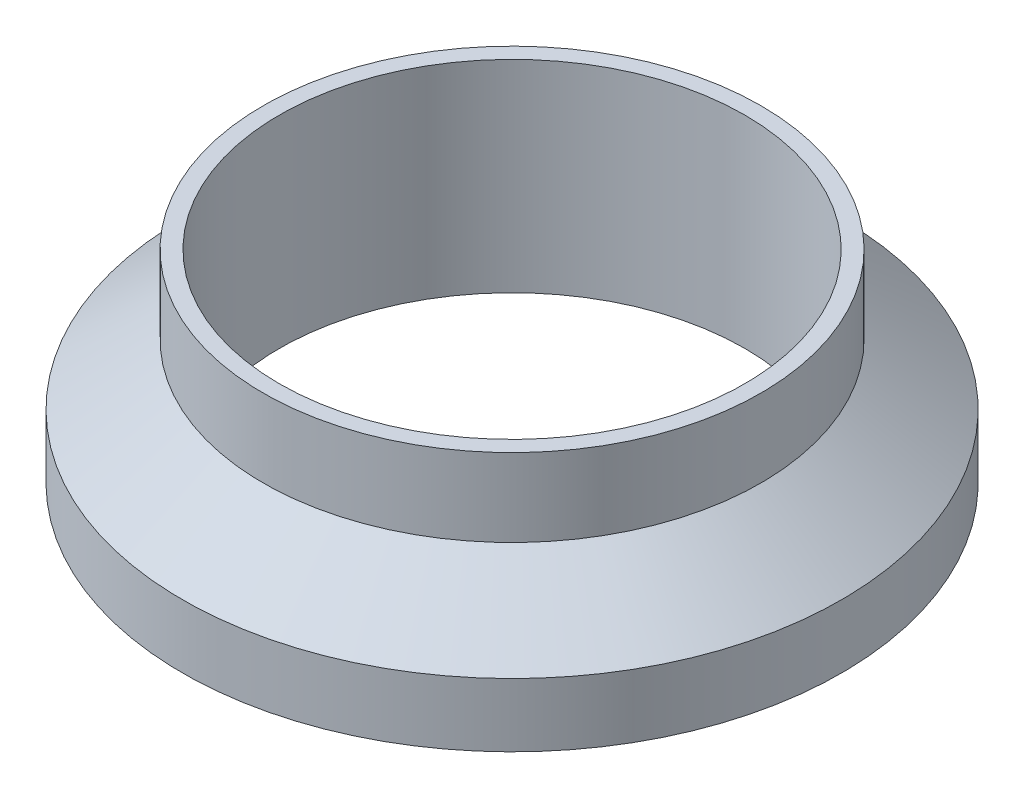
from build123d import *


with BuildPart() as part:
    # Sketch1 → Revolve1 (revolve)
    with BuildSketch(Plane.XY, mode=Mode.PRIVATE) as revolve1_sk:
        with BuildLine():
            Line((-23.749, 0), (-23.749, 20.6248))
            Line((-23.749, 20.6248), (-25.4, 20.6248))
            Line((-25.4, 20.6248), (-25.4, 12.678448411))
            Line((-25.4, 12.678448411), (-33.6296, 6.477))
            Line((-33.6296, 6.477), (-33.6296, 0))
            Line((-33.6296, 0), (-30.230016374, 0))
            ThreePointArc((-30.230016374, 0), (-28.702, 1.1938), (-27.173983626, 0))
            Line((-27.173983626, 0), (-23.749, 0))
        make_face()
    revolve(revolve1_sk.sketch.rotate(Axis((0, 0, 0), (0, 1, 0)), 270), axis=Axis((0, 0, 0), (0, 1, 0)))


solid = part.part
